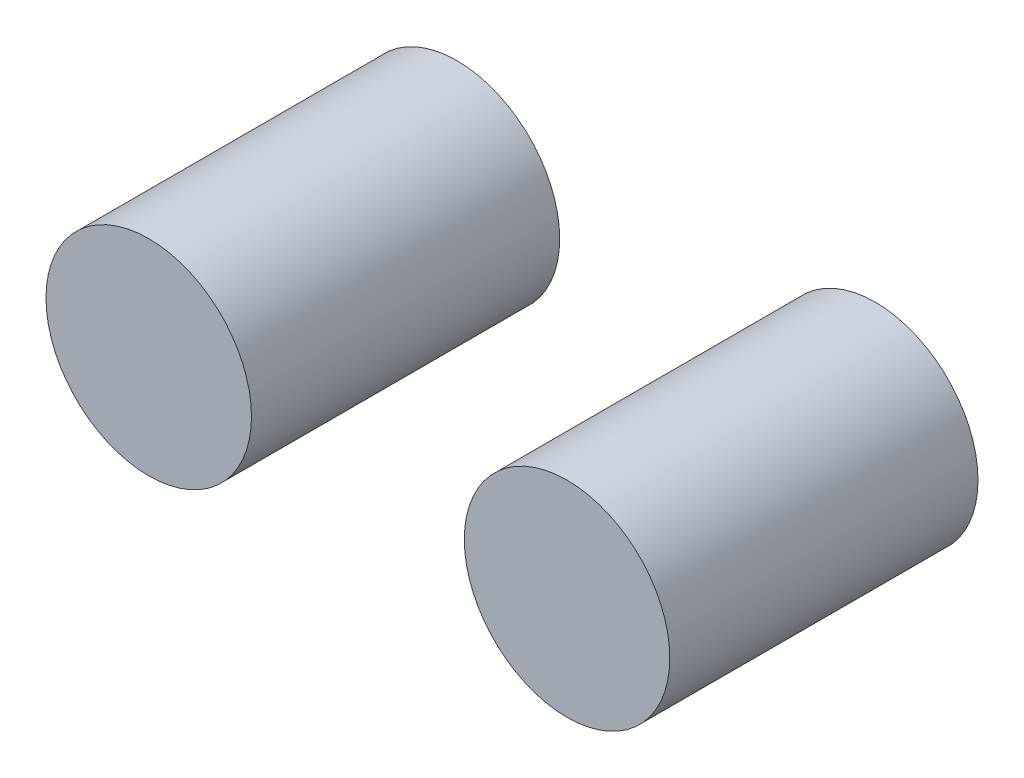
ISO-10303-21;
HEADER;
FILE_DESCRIPTION(('STEP AP214'),'2;1');
FILE_NAME('part.step','',(''),(''),'','','');
FILE_SCHEMA(('AUTOMOTIVE_DESIGN { 1 0 10303 214 1 1 1 1 }'));
ENDSEC;
DATA;
#1=APPLICATION_CONTEXT('core data for automotive mechanical design processes');
#2=APPLICATION_PROTOCOL_DEFINITION('international standard','automotive_design',2000,#1);
#3=PRODUCT_CONTEXT('',#1,'mechanical');
#4=PRODUCT('Part','Part','',(#3));
#5=PRODUCT_RELATED_PRODUCT_CATEGORY('part','',(#4));
#6=PRODUCT_DEFINITION_FORMATION('','',#4);
#7=PRODUCT_DEFINITION_CONTEXT('part definition',#1,'design');
#8=PRODUCT_DEFINITION('design','',#6,#7);
#9=PRODUCT_DEFINITION_SHAPE('','',#8);
#10=(LENGTH_UNIT() NAMED_UNIT(*) SI_UNIT(.MILLI.,.METRE.));
#11=(NAMED_UNIT(*) PLANE_ANGLE_UNIT() SI_UNIT($,.RADIAN.));
#12=(NAMED_UNIT(*) SI_UNIT($,.STERADIAN.) SOLID_ANGLE_UNIT());
#13=UNCERTAINTY_MEASURE_WITH_UNIT(LENGTH_MEASURE(1.E-05),#10,'distance_accuracy_value','');
#14=(GEOMETRIC_REPRESENTATION_CONTEXT(3) GLOBAL_UNCERTAINTY_ASSIGNED_CONTEXT((#13)) GLOBAL_UNIT_ASSIGNED_CONTEXT((#10,
#11,#12)) REPRESENTATION_CONTEXT('',''));
#15=CARTESIAN_POINT('',(0.,0.,0.));
#16=DIRECTION('',(0.,0.,1.));
#17=DIRECTION('',(1.,0.,0.));
#18=AXIS2_PLACEMENT_3D('',#15,#16,#17);
#19=CARTESIAN_POINT('',(-2.79077536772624,7.65690983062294,3.));
#20=DIRECTION('',(0.,0.,-1.));
#21=DIRECTION('',(-1.,0.,0.));
#22=AXIS2_PLACEMENT_3D('',#19,#20,#21);
#23=CYLINDRICAL_SURFACE('',#22,1.);
#24=CARTESIAN_POINT('',(-2.79077536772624,7.65690983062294,3.));
#25=DIRECTION('',(0.,0.,1.));
#26=DIRECTION('',(1.,0.,0.));
#27=AXIS2_PLACEMENT_3D('',#24,#25,#26);
#28=CIRCLE('',#27,1.);
#29=CARTESIAN_POINT('',(-1.79077536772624,7.65690983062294,3.));
#30=VERTEX_POINT('',#29);
#31=EDGE_CURVE('E11',#30,#30,#28,.T.);
#32=ORIENTED_EDGE('',*,*,#31,.F.);
#33=EDGE_LOOP('',(#32));
#34=FACE_BOUND('',#33,.T.);
#35=CARTESIAN_POINT('',(-2.79077536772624,7.65690983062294,0.));
#36=DIRECTION('',(0.,0.,1.));
#37=DIRECTION('',(1.,0.,0.));
#38=AXIS2_PLACEMENT_3D('',#35,#36,#37);
#39=CIRCLE('',#38,1.);
#40=CARTESIAN_POINT('',(-1.79077536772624,7.65690983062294,0.));
#41=VERTEX_POINT('',#40);
#42=EDGE_CURVE('E42',#41,#41,#39,.T.);
#43=ORIENTED_EDGE('',*,*,#42,.T.);
#44=EDGE_LOOP('',(#43));
#45=FACE_BOUND('',#44,.T.);
#46=ADVANCED_FACE('F39',(#34,#45),#23,.T.);
#47=CARTESIAN_POINT('',(-2.79077536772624,7.65690983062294,3.));
#48=DIRECTION('',(0.,0.,1.));
#49=DIRECTION('',(1.,0.,0.));
#50=AXIS2_PLACEMENT_3D('',#47,#48,#49);
#51=PLANE('',#50);
#52=ORIENTED_EDGE('',*,*,#31,.T.);
#53=EDGE_LOOP('',(#52));
#54=FACE_BOUND('',#53,.T.);
#55=ADVANCED_FACE('F54',(#54),#51,.T.);
#56=CARTESIAN_POINT('',(-2.79077536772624,7.65690983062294,0.));
#57=DIRECTION('',(0.,0.,1.));
#58=DIRECTION('',(1.,0.,0.));
#59=AXIS2_PLACEMENT_3D('',#56,#57,#58);
#60=PLANE('',#59);
#61=ORIENTED_EDGE('',*,*,#42,.F.);
#62=EDGE_LOOP('',(#61));
#63=FACE_BOUND('',#62,.T.);
#64=ADVANCED_FACE('F52',(#63),#60,.F.);
#65=CLOSED_SHELL('',(#46,#55,#64));
#66=MANIFOLD_SOLID_BREP('B2',#65);
#67=CARTESIAN_POINT('',(-6.86228259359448,7.65690983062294,3.));
#68=DIRECTION('',(0.,0.,-1.));
#69=DIRECTION('',(-1.,0.,0.));
#70=AXIS2_PLACEMENT_3D('',#67,#68,#69);
#71=CYLINDRICAL_SURFACE('',#70,1.);
#72=CARTESIAN_POINT('',(-6.86228259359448,7.65690983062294,3.));
#73=DIRECTION('',(0.,0.,1.));
#74=DIRECTION('',(1.,0.,0.));
#75=AXIS2_PLACEMENT_3D('',#72,#73,#74);
#76=CIRCLE('',#75,1.);
#77=CARTESIAN_POINT('',(-5.86228259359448,7.65690983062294,3.));
#78=VERTEX_POINT('',#77);
#79=EDGE_CURVE('E38',#78,#78,#76,.T.);
#80=ORIENTED_EDGE('',*,*,#79,.F.);
#81=EDGE_LOOP('',(#80));
#82=FACE_BOUND('',#81,.T.);
#83=CARTESIAN_POINT('',(-6.86228259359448,7.65690983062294,0.));
#84=DIRECTION('',(0.,0.,1.));
#85=DIRECTION('',(1.,0.,0.));
#86=AXIS2_PLACEMENT_3D('',#83,#84,#85);
#87=CIRCLE('',#86,1.);
#88=CARTESIAN_POINT('',(-5.86228259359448,7.65690983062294,0.));
#89=VERTEX_POINT('',#88);
#90=EDGE_CURVE('E83',#89,#89,#87,.T.);
#91=ORIENTED_EDGE('',*,*,#90,.T.);
#92=EDGE_LOOP('',(#91));
#93=FACE_BOUND('',#92,.T.);
#94=ADVANCED_FACE('F80',(#82,#93),#71,.T.);
#95=CARTESIAN_POINT('',(-6.86228259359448,7.65690983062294,3.));
#96=DIRECTION('',(0.,0.,1.));
#97=DIRECTION('',(1.,0.,0.));
#98=AXIS2_PLACEMENT_3D('',#95,#96,#97);
#99=PLANE('',#98);
#100=ORIENTED_EDGE('',*,*,#79,.T.);
#101=EDGE_LOOP('',(#100));
#102=FACE_BOUND('',#101,.T.);
#103=ADVANCED_FACE('F95',(#102),#99,.T.);
#104=CARTESIAN_POINT('',(-6.86228259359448,7.65690983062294,0.));
#105=DIRECTION('',(0.,0.,1.));
#106=DIRECTION('',(1.,0.,0.));
#107=AXIS2_PLACEMENT_3D('',#104,#105,#106);
#108=PLANE('',#107);
#109=ORIENTED_EDGE('',*,*,#90,.F.);
#110=EDGE_LOOP('',(#109));
#111=FACE_BOUND('',#110,.T.);
#112=ADVANCED_FACE('F93',(#111),#108,.F.);
#113=CLOSED_SHELL('',(#94,#103,#112));
#114=MANIFOLD_SOLID_BREP('B6',#113);
#115=ADVANCED_BREP_SHAPE_REPRESENTATION('',(#18,#66,#114),#14);
#116=SHAPE_DEFINITION_REPRESENTATION(#9,#115);
ENDSEC;
END-ISO-10303-21;
